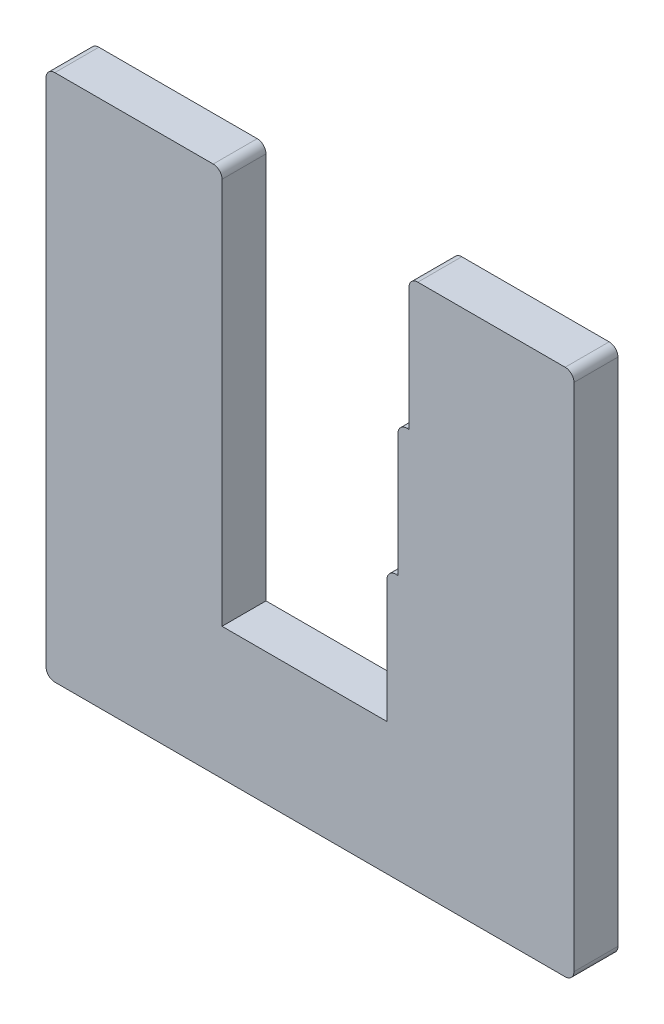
ISO-10303-21;
HEADER;
FILE_DESCRIPTION(('STEP AP214'),'2;1');
FILE_NAME('part.step','',(''),(''),'','','');
FILE_SCHEMA(('AUTOMOTIVE_DESIGN { 1 0 10303 214 1 1 1 1 }'));
ENDSEC;
DATA;
#1=APPLICATION_CONTEXT('core data for automotive mechanical design processes');
#2=APPLICATION_PROTOCOL_DEFINITION('international standard','automotive_design',2000,#1);
#3=PRODUCT_CONTEXT('',#1,'mechanical');
#4=PRODUCT('Part','Part','',(#3));
#5=PRODUCT_RELATED_PRODUCT_CATEGORY('part','',(#4));
#6=PRODUCT_DEFINITION_FORMATION('','',#4);
#7=PRODUCT_DEFINITION_CONTEXT('part definition',#1,'design');
#8=PRODUCT_DEFINITION('design','',#6,#7);
#9=PRODUCT_DEFINITION_SHAPE('','',#8);
#10=(LENGTH_UNIT() NAMED_UNIT(*) SI_UNIT(.MILLI.,.METRE.));
#11=(NAMED_UNIT(*) PLANE_ANGLE_UNIT() SI_UNIT($,.RADIAN.));
#12=(NAMED_UNIT(*) SI_UNIT($,.STERADIAN.) SOLID_ANGLE_UNIT());
#13=UNCERTAINTY_MEASURE_WITH_UNIT(LENGTH_MEASURE(1.E-05),#10,'distance_accuracy_value','');
#14=(GEOMETRIC_REPRESENTATION_CONTEXT(3) GLOBAL_UNCERTAINTY_ASSIGNED_CONTEXT((#13)) GLOBAL_UNIT_ASSIGNED_CONTEXT((#10,
#11,#12)) REPRESENTATION_CONTEXT('',''));
#15=CARTESIAN_POINT('',(0.,0.,0.));
#16=DIRECTION('',(0.,0.,1.));
#17=DIRECTION('',(1.,0.,0.));
#18=AXIS2_PLACEMENT_3D('',#15,#16,#17);
#19=CARTESIAN_POINT('',(0.,120.,10.));
#20=DIRECTION('',(0.,-1.,0.));
#21=DIRECTION('',(0.,0.,-1.));
#22=AXIS2_PLACEMENT_3D('',#19,#20,#21);
#23=PLANE('',#22);
#24=DIRECTION('',(-1.,0.,0.));
#25=VECTOR('',#24,1.);
#26=CARTESIAN_POINT('',(0.,120.,10.));
#27=LINE('',#26,#25);
#28=CARTESIAN_POINT('',(38.,120.,10.));
#29=VERTEX_POINT('',#28);
#30=CARTESIAN_POINT('',(2.,120.,10.));
#31=VERTEX_POINT('',#30);
#32=EDGE_CURVE('E243',#29,#31,#27,.T.);
#33=ORIENTED_EDGE('',*,*,#32,.F.);
#34=DIRECTION('',(0.,0.,1.));
#35=VECTOR('',#34,1.);
#36=CARTESIAN_POINT('',(38.,120.,10.));
#37=LINE('',#36,#35);
#38=CARTESIAN_POINT('',(38.,120.,0.));
#39=VERTEX_POINT('',#38);
#40=EDGE_CURVE('E57',#29,#39,#37,.F.);
#41=ORIENTED_EDGE('',*,*,#40,.T.);
#42=DIRECTION('',(-1.,0.,0.));
#43=VECTOR('',#42,1.);
#44=CARTESIAN_POINT('',(0.,120.,0.));
#45=LINE('',#44,#43);
#46=CARTESIAN_POINT('',(2.,120.,0.));
#47=VERTEX_POINT('',#46);
#48=EDGE_CURVE('E256',#39,#47,#45,.T.);
#49=ORIENTED_EDGE('',*,*,#48,.T.);
#50=DIRECTION('',(0.,0.,-1.));
#51=VECTOR('',#50,1.);
#52=CARTESIAN_POINT('',(2.,120.,10.));
#53=LINE('',#52,#51);
#54=EDGE_CURVE('E314',#47,#31,#53,.F.);
#55=ORIENTED_EDGE('',*,*,#54,.T.);
#56=EDGE_LOOP('',(#33,#41,#49,#55));
#57=FACE_BOUND('',#56,.T.);
#58=ADVANCED_FACE('F35',(#57),#23,.F.);
#59=CARTESIAN_POINT('',(0.,0.,10.));
#60=DIRECTION('',(1.,0.,0.));
#61=DIRECTION('',(0.,0.,-1.));
#62=AXIS2_PLACEMENT_3D('',#59,#60,#61);
#63=PLANE('',#62);
#64=DIRECTION('',(0.,-1.,0.));
#65=VECTOR('',#64,1.);
#66=CARTESIAN_POINT('',(0.,0.,0.));
#67=LINE('',#66,#65);
#68=CARTESIAN_POINT('',(0.,118.,0.));
#69=VERTEX_POINT('',#68);
#70=CARTESIAN_POINT('',(0.,2.,0.));
#71=VERTEX_POINT('',#70);
#72=EDGE_CURVE('E232',#69,#71,#67,.T.);
#73=ORIENTED_EDGE('',*,*,#72,.T.);
#74=DIRECTION('',(0.,0.,-1.));
#75=VECTOR('',#74,1.);
#76=CARTESIAN_POINT('',(0.,2.,10.));
#77=LINE('',#76,#75);
#78=CARTESIAN_POINT('',(0.,2.,10.));
#79=VERTEX_POINT('',#78);
#80=EDGE_CURVE('E310',#71,#79,#77,.F.);
#81=ORIENTED_EDGE('',*,*,#80,.T.);
#82=DIRECTION('',(0.,-1.,0.));
#83=VECTOR('',#82,1.);
#84=CARTESIAN_POINT('',(0.,0.,10.));
#85=LINE('',#84,#83);
#86=CARTESIAN_POINT('',(0.,118.,10.));
#87=VERTEX_POINT('',#86);
#88=EDGE_CURVE('E233',#87,#79,#85,.T.);
#89=ORIENTED_EDGE('',*,*,#88,.F.);
#90=DIRECTION('',(0.,0.,-1.));
#91=VECTOR('',#90,1.);
#92=CARTESIAN_POINT('',(0.,118.,10.));
#93=LINE('',#92,#91);
#94=EDGE_CURVE('E307',#87,#69,#93,.T.);
#95=ORIENTED_EDGE('',*,*,#94,.T.);
#96=EDGE_LOOP('',(#73,#81,#89,#95));
#97=FACE_BOUND('',#96,.T.);
#98=ADVANCED_FACE('F382',(#97),#63,.F.);
#99=CARTESIAN_POINT('',(0.,0.,10.));
#100=DIRECTION('',(0.,1.,0.));
#101=DIRECTION('',(0.,0.,1.));
#102=AXIS2_PLACEMENT_3D('',#99,#100,#101);
#103=PLANE('',#102);
#104=DIRECTION('',(1.,0.,0.));
#105=VECTOR('',#104,1.);
#106=CARTESIAN_POINT('',(0.,0.,0.));
#107=LINE('',#106,#105);
#108=CARTESIAN_POINT('',(2.,0.,0.));
#109=VERTEX_POINT('',#108);
#110=CARTESIAN_POINT('',(118.,0.,0.));
#111=VERTEX_POINT('',#110);
#112=EDGE_CURVE('E250',#109,#111,#107,.T.);
#113=ORIENTED_EDGE('',*,*,#112,.T.);
#114=DIRECTION('',(0.,0.,-1.));
#115=VECTOR('',#114,1.);
#116=CARTESIAN_POINT('',(118.,0.,10.));
#117=LINE('',#116,#115);
#118=CARTESIAN_POINT('',(118.,0.,10.));
#119=VERTEX_POINT('',#118);
#120=EDGE_CURVE('E305',#111,#119,#117,.F.);
#121=ORIENTED_EDGE('',*,*,#120,.T.);
#122=DIRECTION('',(1.,0.,0.));
#123=VECTOR('',#122,1.);
#124=CARTESIAN_POINT('',(0.,0.,10.));
#125=LINE('',#124,#123);
#126=CARTESIAN_POINT('',(2.,0.,10.));
#127=VERTEX_POINT('',#126);
#128=EDGE_CURVE('E236',#127,#119,#125,.T.);
#129=ORIENTED_EDGE('',*,*,#128,.F.);
#130=DIRECTION('',(0.,0.,-1.));
#131=VECTOR('',#130,1.);
#132=CARTESIAN_POINT('',(2.,0.,10.));
#133=LINE('',#132,#131);
#134=EDGE_CURVE('E302',#127,#109,#133,.T.);
#135=ORIENTED_EDGE('',*,*,#134,.T.);
#136=EDGE_LOOP('',(#113,#121,#129,#135));
#137=FACE_BOUND('',#136,.T.);
#138=ADVANCED_FACE('F387',(#137),#103,.F.);
#139=CARTESIAN_POINT('',(120.,0.,10.));
#140=DIRECTION('',(-1.,0.,0.));
#141=DIRECTION('',(0.,0.,1.));
#142=AXIS2_PLACEMENT_3D('',#139,#140,#141);
#143=PLANE('',#142);
#144=DIRECTION('',(0.,1.,0.));
#145=VECTOR('',#144,1.);
#146=CARTESIAN_POINT('',(120.,0.,10.));
#147=LINE('',#146,#145);
#148=CARTESIAN_POINT('',(120.,2.,10.));
#149=VERTEX_POINT('',#148);
#150=CARTESIAN_POINT('',(120.,118.,10.));
#151=VERTEX_POINT('',#150);
#152=EDGE_CURVE('E240',#149,#151,#147,.T.);
#153=ORIENTED_EDGE('',*,*,#152,.F.);
#154=DIRECTION('',(0.,0.,-1.));
#155=VECTOR('',#154,1.);
#156=CARTESIAN_POINT('',(120.,2.,10.));
#157=LINE('',#156,#155);
#158=CARTESIAN_POINT('',(120.,2.,0.));
#159=VERTEX_POINT('',#158);
#160=EDGE_CURVE('E299',#149,#159,#157,.T.);
#161=ORIENTED_EDGE('',*,*,#160,.T.);
#162=DIRECTION('',(0.,1.,0.));
#163=VECTOR('',#162,1.);
#164=CARTESIAN_POINT('',(120.,0.,0.));
#165=LINE('',#164,#163);
#166=CARTESIAN_POINT('',(120.,118.,0.));
#167=VERTEX_POINT('',#166);
#168=EDGE_CURVE('E253',#159,#167,#165,.T.);
#169=ORIENTED_EDGE('',*,*,#168,.T.);
#170=DIRECTION('',(0.,0.,-1.));
#171=VECTOR('',#170,1.);
#172=CARTESIAN_POINT('',(120.,118.,10.));
#173=LINE('',#172,#171);
#174=EDGE_CURVE('E297',#167,#151,#173,.F.);
#175=ORIENTED_EDGE('',*,*,#174,.T.);
#176=EDGE_LOOP('',(#153,#161,#169,#175));
#177=FACE_BOUND('',#176,.T.);
#178=ADVANCED_FACE('F393',(#177),#143,.F.);
#179=CARTESIAN_POINT('',(118.,120.,0.));
#180=VERTEX_POINT('',#179);
#181=CARTESIAN_POINT('',(84.5,120.,0.));
#182=VERTEX_POINT('',#181);
#183=EDGE_CURVE('E237',#180,#182,#45,.T.);
#184=ORIENTED_EDGE('',*,*,#183,.T.);
#185=DIRECTION('',(0.,0.,1.));
#186=VECTOR('',#185,1.);
#187=CARTESIAN_POINT('',(84.5,120.,10.));
#188=LINE('',#187,#186);
#189=CARTESIAN_POINT('',(84.5,120.,10.));
#190=VERTEX_POINT('',#189);
#191=EDGE_CURVE('E43',#182,#190,#188,.T.);
#192=ORIENTED_EDGE('',*,*,#191,.T.);
#193=CARTESIAN_POINT('',(118.,120.,10.));
#194=VERTEX_POINT('',#193);
#195=EDGE_CURVE('E244',#194,#190,#27,.T.);
#196=ORIENTED_EDGE('',*,*,#195,.F.);
#197=DIRECTION('',(0.,0.,-1.));
#198=VECTOR('',#197,1.);
#199=CARTESIAN_POINT('',(118.,120.,10.));
#200=LINE('',#199,#198);
#201=EDGE_CURVE('E317',#194,#180,#200,.T.);
#202=ORIENTED_EDGE('',*,*,#201,.T.);
#203=EDGE_LOOP('',(#184,#192,#196,#202));
#204=FACE_BOUND('',#203,.T.);
#205=ADVANCED_FACE('F324',(#204),#23,.F.);
#206=CARTESIAN_POINT('',(0.,0.,10.));
#207=DIRECTION('',(0.,0.,-1.));
#208=DIRECTION('',(-1.,0.,0.));
#209=AXIS2_PLACEMENT_3D('',#206,#207,#208);
#210=PLANE('',#209);
#211=DIRECTION('',(1.,0.,0.));
#212=VECTOR('',#211,1.);
#213=CARTESIAN_POINT('',(40.,90.,10.));
#214=LINE('',#213,#212);
#215=CARTESIAN_POINT('',(82.,90.,10.));
#216=VERTEX_POINT('',#215);
#217=CARTESIAN_POINT('',(82.5,90.,10.));
#218=VERTEX_POINT('',#217);
#219=EDGE_CURVE('E226',#216,#218,#214,.T.);
#220=ORIENTED_EDGE('',*,*,#219,.F.);
#221=CARTESIAN_POINT('',(82.,88.,10.));
#222=DIRECTION('',(0.,0.,-1.));
#223=DIRECTION('',(-1.,0.,0.));
#224=AXIS2_PLACEMENT_3D('',#221,#222,#223);
#225=CIRCLE('',#224,2.);
#226=CARTESIAN_POINT('',(80.,88.,10.));
#227=VERTEX_POINT('',#226);
#228=EDGE_CURVE('E274',#216,#227,#225,.F.);
#229=ORIENTED_EDGE('',*,*,#228,.T.);
#230=DIRECTION('',(0.,1.,0.));
#231=VECTOR('',#230,1.);
#232=CARTESIAN_POINT('',(80.,90.,10.));
#233=LINE('',#232,#231);
#234=CARTESIAN_POINT('',(80.,60.,10.));
#235=VERTEX_POINT('',#234);
#236=EDGE_CURVE('E212',#235,#227,#233,.T.);
#237=ORIENTED_EDGE('',*,*,#236,.F.);
#238=DIRECTION('',(1.,0.,0.));
#239=VECTOR('',#238,1.);
#240=CARTESIAN_POINT('',(40.,60.,10.));
#241=LINE('',#240,#239);
#242=CARTESIAN_POINT('',(79.5,60.,10.));
#243=VERTEX_POINT('',#242);
#244=EDGE_CURVE('E207',#243,#235,#241,.T.);
#245=ORIENTED_EDGE('',*,*,#244,.F.);
#246=CARTESIAN_POINT('',(79.5,58.,10.));
#247=DIRECTION('',(0.,0.,-1.));
#248=DIRECTION('',(-1.,0.,0.));
#249=AXIS2_PLACEMENT_3D('',#246,#247,#248);
#250=CIRCLE('',#249,2.);
#251=CARTESIAN_POINT('',(77.5,58.,10.));
#252=VERTEX_POINT('',#251);
#253=EDGE_CURVE('E272',#243,#252,#250,.F.);
#254=ORIENTED_EDGE('',*,*,#253,.T.);
#255=DIRECTION('',(0.,1.,0.));
#256=VECTOR('',#255,1.);
#257=CARTESIAN_POINT('',(77.5,60.,10.));
#258=LINE('',#257,#256);
#259=CARTESIAN_POINT('',(77.5,30.,10.));
#260=VERTEX_POINT('',#259);
#261=EDGE_CURVE('E199',#260,#252,#258,.T.);
#262=ORIENTED_EDGE('',*,*,#261,.F.);
#263=DIRECTION('',(1.,0.,0.));
#264=VECTOR('',#263,1.);
#265=CARTESIAN_POINT('',(40.,30.,10.));
#266=LINE('',#265,#264);
#267=CARTESIAN_POINT('',(40.,30.,10.));
#268=VERTEX_POINT('',#267);
#269=EDGE_CURVE('E203',#268,#260,#266,.T.);
#270=ORIENTED_EDGE('',*,*,#269,.F.);
#271=DIRECTION('',(0.,-1.,0.));
#272=VECTOR('',#271,1.);
#273=CARTESIAN_POINT('',(40.,120.,10.));
#274=LINE('',#273,#272);
#275=CARTESIAN_POINT('',(40.,118.,10.));
#276=VERTEX_POINT('',#275);
#277=EDGE_CURVE('E190',#276,#268,#274,.T.);
#278=ORIENTED_EDGE('',*,*,#277,.F.);
#279=CARTESIAN_POINT('',(38.,118.,10.));
#280=DIRECTION('',(0.,0.,-1.));
#281=DIRECTION('',(-1.,0.,0.));
#282=AXIS2_PLACEMENT_3D('',#279,#280,#281);
#283=CIRCLE('',#282,2.);
#284=EDGE_CURVE('E266',#276,#29,#283,.F.);
#285=ORIENTED_EDGE('',*,*,#284,.T.);
#286=ORIENTED_EDGE('',*,*,#32,.T.);
#287=CARTESIAN_POINT('',(2.,118.,10.));
#288=DIRECTION('',(0.,0.,-1.));
#289=DIRECTION('',(-1.,0.,0.));
#290=AXIS2_PLACEMENT_3D('',#287,#288,#289);
#291=CIRCLE('',#290,2.);
#292=EDGE_CURVE('E260',#31,#87,#291,.F.);
#293=ORIENTED_EDGE('',*,*,#292,.T.);
#294=ORIENTED_EDGE('',*,*,#88,.T.);
#295=CARTESIAN_POINT('',(2.,2.,10.));
#296=DIRECTION('',(0.,0.,-1.));
#297=DIRECTION('',(-1.,0.,0.));
#298=AXIS2_PLACEMENT_3D('',#295,#296,#297);
#299=CIRCLE('',#298,2.);
#300=EDGE_CURVE('E268',#79,#127,#299,.F.);
#301=ORIENTED_EDGE('',*,*,#300,.T.);
#302=ORIENTED_EDGE('',*,*,#128,.T.);
#303=CARTESIAN_POINT('',(118.,2.,10.));
#304=DIRECTION('',(0.,0.,-1.));
#305=DIRECTION('',(-1.,0.,0.));
#306=AXIS2_PLACEMENT_3D('',#303,#304,#305);
#307=CIRCLE('',#306,2.);
#308=EDGE_CURVE('E270',#119,#149,#307,.F.);
#309=ORIENTED_EDGE('',*,*,#308,.T.);
#310=ORIENTED_EDGE('',*,*,#152,.T.);
#311=CARTESIAN_POINT('',(118.,118.,10.));
#312=DIRECTION('',(0.,0.,-1.));
#313=DIRECTION('',(-1.,0.,0.));
#314=AXIS2_PLACEMENT_3D('',#311,#312,#313);
#315=CIRCLE('',#314,2.);
#316=EDGE_CURVE('E262',#151,#194,#315,.F.);
#317=ORIENTED_EDGE('',*,*,#316,.T.);
#318=ORIENTED_EDGE('',*,*,#195,.T.);
#319=CARTESIAN_POINT('',(84.5,118.,10.));
#320=DIRECTION('',(0.,0.,-1.));
#321=DIRECTION('',(-1.,0.,0.));
#322=AXIS2_PLACEMENT_3D('',#319,#320,#321);
#323=CIRCLE('',#322,2.);
#324=CARTESIAN_POINT('',(82.5,118.,10.));
#325=VERTEX_POINT('',#324);
#326=EDGE_CURVE('E264',#190,#325,#323,.F.);
#327=ORIENTED_EDGE('',*,*,#326,.T.);
#328=DIRECTION('',(0.,1.,0.));
#329=VECTOR('',#328,1.);
#330=CARTESIAN_POINT('',(82.5,120.,10.));
#331=LINE('',#330,#329);
#332=EDGE_CURVE('E184',#218,#325,#331,.T.);
#333=ORIENTED_EDGE('',*,*,#332,.F.);
#334=EDGE_LOOP('',(#220,#229,#237,#245,#254,#262,#270,#278,#285,#286,#293,#294,#301,#302,#309,
#310,#317,#318,#327,#333));
#335=FACE_BOUND('',#334,.T.);
#336=ADVANCED_FACE('F331',(#335),#210,.F.);
#337=CARTESIAN_POINT('',(0.,0.,0.));
#338=DIRECTION('',(0.,0.,-1.));
#339=DIRECTION('',(-1.,0.,0.));
#340=AXIS2_PLACEMENT_3D('',#337,#338,#339);
#341=PLANE('',#340);
#342=DIRECTION('',(0.,1.,0.));
#343=VECTOR('',#342,1.);
#344=CARTESIAN_POINT('',(80.,90.,0.));
#345=LINE('',#344,#343);
#346=CARTESIAN_POINT('',(80.,60.,0.));
#347=VERTEX_POINT('',#346);
#348=CARTESIAN_POINT('',(80.,88.,0.));
#349=VERTEX_POINT('',#348);
#350=EDGE_CURVE('E211',#347,#349,#345,.T.);
#351=ORIENTED_EDGE('',*,*,#350,.T.);
#352=CARTESIAN_POINT('',(82.,88.,0.));
#353=DIRECTION('',(0.,0.,-1.));
#354=DIRECTION('',(-1.,0.,0.));
#355=AXIS2_PLACEMENT_3D('',#352,#353,#354);
#356=CIRCLE('',#355,2.);
#357=CARTESIAN_POINT('',(82.,90.,0.));
#358=VERTEX_POINT('',#357);
#359=EDGE_CURVE('E290',#349,#358,#356,.T.);
#360=ORIENTED_EDGE('',*,*,#359,.T.);
#361=DIRECTION('',(1.,0.,0.));
#362=VECTOR('',#361,1.);
#363=CARTESIAN_POINT('',(40.,90.,0.));
#364=LINE('',#363,#362);
#365=CARTESIAN_POINT('',(82.5,90.,0.));
#366=VERTEX_POINT('',#365);
#367=EDGE_CURVE('E183',#358,#366,#364,.T.);
#368=ORIENTED_EDGE('',*,*,#367,.T.);
#369=DIRECTION('',(0.,1.,0.));
#370=VECTOR('',#369,1.);
#371=CARTESIAN_POINT('',(82.5,120.,0.));
#372=LINE('',#371,#370);
#373=CARTESIAN_POINT('',(82.5,118.,0.));
#374=VERTEX_POINT('',#373);
#375=EDGE_CURVE('E221',#366,#374,#372,.T.);
#376=ORIENTED_EDGE('',*,*,#375,.T.);
#377=CARTESIAN_POINT('',(84.5,118.,0.));
#378=DIRECTION('',(0.,0.,-1.));
#379=DIRECTION('',(-1.,0.,0.));
#380=AXIS2_PLACEMENT_3D('',#377,#378,#379);
#381=CIRCLE('',#380,2.);
#382=EDGE_CURVE('E281',#374,#182,#381,.T.);
#383=ORIENTED_EDGE('',*,*,#382,.T.);
#384=ORIENTED_EDGE('',*,*,#183,.F.);
#385=CARTESIAN_POINT('',(118.,118.,0.));
#386=DIRECTION('',(0.,0.,-1.));
#387=DIRECTION('',(-1.,0.,0.));
#388=AXIS2_PLACEMENT_3D('',#385,#386,#387);
#389=CIRCLE('',#388,2.);
#390=EDGE_CURVE('E279',#180,#167,#389,.T.);
#391=ORIENTED_EDGE('',*,*,#390,.T.);
#392=ORIENTED_EDGE('',*,*,#168,.F.);
#393=CARTESIAN_POINT('',(118.,2.,0.));
#394=DIRECTION('',(0.,0.,-1.));
#395=DIRECTION('',(-1.,0.,0.));
#396=AXIS2_PLACEMENT_3D('',#393,#394,#395);
#397=CIRCLE('',#396,2.);
#398=EDGE_CURVE('E286',#159,#111,#397,.T.);
#399=ORIENTED_EDGE('',*,*,#398,.T.);
#400=ORIENTED_EDGE('',*,*,#112,.F.);
#401=CARTESIAN_POINT('',(2.,2.,0.));
#402=DIRECTION('',(0.,0.,-1.));
#403=DIRECTION('',(-1.,0.,0.));
#404=AXIS2_PLACEMENT_3D('',#401,#402,#403);
#405=CIRCLE('',#404,2.);
#406=EDGE_CURVE('E284',#109,#71,#405,.T.);
#407=ORIENTED_EDGE('',*,*,#406,.T.);
#408=ORIENTED_EDGE('',*,*,#72,.F.);
#409=CARTESIAN_POINT('',(2.,118.,0.));
#410=DIRECTION('',(0.,0.,-1.));
#411=DIRECTION('',(-1.,0.,0.));
#412=AXIS2_PLACEMENT_3D('',#409,#410,#411);
#413=CIRCLE('',#412,2.);
#414=EDGE_CURVE('E50',#69,#47,#413,.T.);
#415=ORIENTED_EDGE('',*,*,#414,.T.);
#416=ORIENTED_EDGE('',*,*,#48,.F.);
#417=CARTESIAN_POINT('',(38.,118.,0.));
#418=DIRECTION('',(0.,0.,-1.));
#419=DIRECTION('',(-1.,0.,0.));
#420=AXIS2_PLACEMENT_3D('',#417,#418,#419);
#421=CIRCLE('',#420,2.);
#422=CARTESIAN_POINT('',(40.,118.,0.));
#423=VERTEX_POINT('',#422);
#424=EDGE_CURVE('E179',#39,#423,#421,.T.);
#425=ORIENTED_EDGE('',*,*,#424,.T.);
#426=DIRECTION('',(0.,-1.,0.));
#427=VECTOR('',#426,1.);
#428=CARTESIAN_POINT('',(40.,120.,0.));
#429=LINE('',#428,#427);
#430=CARTESIAN_POINT('',(40.,30.,0.));
#431=VERTEX_POINT('',#430);
#432=EDGE_CURVE('E171',#423,#431,#429,.T.);
#433=ORIENTED_EDGE('',*,*,#432,.T.);
#434=DIRECTION('',(1.,0.,0.));
#435=VECTOR('',#434,1.);
#436=CARTESIAN_POINT('',(40.,30.,0.));
#437=LINE('',#436,#435);
#438=CARTESIAN_POINT('',(77.5,30.,0.));
#439=VERTEX_POINT('',#438);
#440=EDGE_CURVE('E177',#431,#439,#437,.T.);
#441=ORIENTED_EDGE('',*,*,#440,.T.);
#442=DIRECTION('',(0.,1.,0.));
#443=VECTOR('',#442,1.);
#444=CARTESIAN_POINT('',(77.5,60.,0.));
#445=LINE('',#444,#443);
#446=CARTESIAN_POINT('',(77.5,58.,0.));
#447=VERTEX_POINT('',#446);
#448=EDGE_CURVE('E195',#439,#447,#445,.T.);
#449=ORIENTED_EDGE('',*,*,#448,.T.);
#450=CARTESIAN_POINT('',(79.5,58.,0.));
#451=DIRECTION('',(0.,0.,-1.));
#452=DIRECTION('',(-1.,0.,0.));
#453=AXIS2_PLACEMENT_3D('',#450,#451,#452);
#454=CIRCLE('',#453,2.);
#455=CARTESIAN_POINT('',(79.5,60.,0.));
#456=VERTEX_POINT('',#455);
#457=EDGE_CURVE('E288',#447,#456,#454,.T.);
#458=ORIENTED_EDGE('',*,*,#457,.T.);
#459=DIRECTION('',(1.,0.,0.));
#460=VECTOR('',#459,1.);
#461=CARTESIAN_POINT('',(40.,60.,0.));
#462=LINE('',#461,#460);
#463=EDGE_CURVE('E209',#456,#347,#462,.T.);
#464=ORIENTED_EDGE('',*,*,#463,.T.);
#465=EDGE_LOOP('',(#351,#360,#368,#376,#383,#384,#391,#392,#399,#400,#407,#408,#415,#416,#425,
#433,#441,#449,#458,#464));
#466=FACE_BOUND('',#465,.T.);
#467=ADVANCED_FACE('F174',(#466),#341,.T.);
#468=CARTESIAN_POINT('',(40.,120.,0.));
#469=DIRECTION('',(-1.,0.,0.));
#470=DIRECTION('',(0.,0.,1.));
#471=AXIS2_PLACEMENT_3D('',#468,#469,#470);
#472=PLANE('',#471);
#473=ORIENTED_EDGE('',*,*,#432,.F.);
#474=DIRECTION('',(0.,0.,1.));
#475=VECTOR('',#474,1.);
#476=CARTESIAN_POINT('',(40.,118.,0.));
#477=LINE('',#476,#475);
#478=EDGE_CURVE('E312',#423,#276,#477,.T.);
#479=ORIENTED_EDGE('',*,*,#478,.T.);
#480=ORIENTED_EDGE('',*,*,#277,.T.);
#481=DIRECTION('',(0.,0.,1.));
#482=VECTOR('',#481,1.);
#483=CARTESIAN_POINT('',(40.,30.,0.));
#484=LINE('',#483,#482);
#485=EDGE_CURVE('E187',#431,#268,#484,.T.);
#486=ORIENTED_EDGE('',*,*,#485,.F.);
#487=EDGE_LOOP('',(#473,#479,#480,#486));
#488=FACE_BOUND('',#487,.T.);
#489=ADVANCED_FACE('F188',(#488),#472,.F.);
#490=CARTESIAN_POINT('',(82.5,120.,0.));
#491=DIRECTION('',(1.,0.,0.));
#492=DIRECTION('',(0.,0.,-1.));
#493=AXIS2_PLACEMENT_3D('',#490,#491,#492);
#494=PLANE('',#493);
#495=ORIENTED_EDGE('',*,*,#332,.T.);
#496=DIRECTION('',(0.,0.,1.));
#497=VECTOR('',#496,1.);
#498=CARTESIAN_POINT('',(82.5,118.,0.));
#499=LINE('',#498,#497);
#500=EDGE_CURVE('E11',#325,#374,#499,.F.);
#501=ORIENTED_EDGE('',*,*,#500,.T.);
#502=ORIENTED_EDGE('',*,*,#375,.F.);
#503=DIRECTION('',(0.,0.,1.));
#504=VECTOR('',#503,1.);
#505=CARTESIAN_POINT('',(82.5,90.,0.));
#506=LINE('',#505,#504);
#507=EDGE_CURVE('E224',#366,#218,#506,.T.);
#508=ORIENTED_EDGE('',*,*,#507,.T.);
#509=EDGE_LOOP('',(#495,#501,#502,#508));
#510=FACE_BOUND('',#509,.T.);
#511=ADVANCED_FACE('F343',(#510),#494,.F.);
#512=CARTESIAN_POINT('',(40.,90.,0.));
#513=DIRECTION('',(0.,-1.,0.));
#514=DIRECTION('',(0.,0.,-1.));
#515=AXIS2_PLACEMENT_3D('',#512,#513,#514);
#516=PLANE('',#515);
#517=ORIENTED_EDGE('',*,*,#367,.F.);
#518=DIRECTION('',(0.,0.,1.));
#519=VECTOR('',#518,1.);
#520=CARTESIAN_POINT('',(82.,90.,0.));
#521=LINE('',#520,#519);
#522=EDGE_CURVE('E247',#358,#216,#521,.T.);
#523=ORIENTED_EDGE('',*,*,#522,.T.);
#524=ORIENTED_EDGE('',*,*,#219,.T.);
#525=ORIENTED_EDGE('',*,*,#507,.F.);
#526=EDGE_LOOP('',(#517,#523,#524,#525));
#527=FACE_BOUND('',#526,.T.);
#528=ADVANCED_FACE('F348',(#527),#516,.F.);
#529=CARTESIAN_POINT('',(80.,90.,0.));
#530=DIRECTION('',(1.,0.,0.));
#531=DIRECTION('',(0.,0.,-1.));
#532=AXIS2_PLACEMENT_3D('',#529,#530,#531);
#533=PLANE('',#532);
#534=ORIENTED_EDGE('',*,*,#236,.T.);
#535=DIRECTION('',(0.,0.,1.));
#536=VECTOR('',#535,1.);
#537=CARTESIAN_POINT('',(80.,88.,0.));
#538=LINE('',#537,#536);
#539=EDGE_CURVE('E276',#227,#349,#538,.F.);
#540=ORIENTED_EDGE('',*,*,#539,.T.);
#541=ORIENTED_EDGE('',*,*,#350,.F.);
#542=DIRECTION('',(0.,0.,1.));
#543=VECTOR('',#542,1.);
#544=CARTESIAN_POINT('',(80.,60.,0.));
#545=LINE('',#544,#543);
#546=EDGE_CURVE('E214',#347,#235,#545,.T.);
#547=ORIENTED_EDGE('',*,*,#546,.T.);
#548=EDGE_LOOP('',(#534,#540,#541,#547));
#549=FACE_BOUND('',#548,.T.);
#550=ADVANCED_FACE('F356',(#549),#533,.F.);
#551=CARTESIAN_POINT('',(40.,60.,0.));
#552=DIRECTION('',(0.,-1.,0.));
#553=DIRECTION('',(0.,0.,-1.));
#554=AXIS2_PLACEMENT_3D('',#551,#552,#553);
#555=PLANE('',#554);
#556=ORIENTED_EDGE('',*,*,#463,.F.);
#557=DIRECTION('',(0.,0.,1.));
#558=VECTOR('',#557,1.);
#559=CARTESIAN_POINT('',(79.5,60.,0.));
#560=LINE('',#559,#558);
#561=EDGE_CURVE('E292',#456,#243,#560,.T.);
#562=ORIENTED_EDGE('',*,*,#561,.T.);
#563=ORIENTED_EDGE('',*,*,#244,.T.);
#564=ORIENTED_EDGE('',*,*,#546,.F.);
#565=EDGE_LOOP('',(#556,#562,#563,#564));
#566=FACE_BOUND('',#565,.T.);
#567=ADVANCED_FACE('F362',(#566),#555,.F.);
#568=CARTESIAN_POINT('',(77.5,60.,0.));
#569=DIRECTION('',(1.,0.,0.));
#570=DIRECTION('',(0.,1.,0.));
#571=AXIS2_PLACEMENT_3D('',#568,#569,#570);
#572=PLANE('',#571);
#573=ORIENTED_EDGE('',*,*,#261,.T.);
#574=DIRECTION('',(0.,0.,1.));
#575=VECTOR('',#574,1.);
#576=CARTESIAN_POINT('',(77.5,58.,0.));
#577=LINE('',#576,#575);
#578=EDGE_CURVE('E295',#252,#447,#577,.F.);
#579=ORIENTED_EDGE('',*,*,#578,.T.);
#580=ORIENTED_EDGE('',*,*,#448,.F.);
#581=DIRECTION('',(0.,0.,1.));
#582=VECTOR('',#581,1.);
#583=CARTESIAN_POINT('',(77.5,30.,0.));
#584=LINE('',#583,#582);
#585=EDGE_CURVE('E194',#439,#260,#584,.T.);
#586=ORIENTED_EDGE('',*,*,#585,.T.);
#587=EDGE_LOOP('',(#573,#579,#580,#586));
#588=FACE_BOUND('',#587,.T.);
#589=ADVANCED_FACE('F368',(#588),#572,.F.);
#590=CARTESIAN_POINT('',(40.,30.,0.));
#591=DIRECTION('',(0.,-1.,0.));
#592=DIRECTION('',(0.,0.,-1.));
#593=AXIS2_PLACEMENT_3D('',#590,#591,#592);
#594=PLANE('',#593);
#595=ORIENTED_EDGE('',*,*,#269,.T.);
#596=ORIENTED_EDGE('',*,*,#585,.F.);
#597=ORIENTED_EDGE('',*,*,#440,.F.);
#598=ORIENTED_EDGE('',*,*,#485,.T.);
#599=EDGE_LOOP('',(#595,#596,#597,#598));
#600=FACE_BOUND('',#599,.T.);
#601=ADVANCED_FACE('F197',(#600),#594,.F.);
#602=CARTESIAN_POINT('',(82.,88.,0.));
#603=DIRECTION('',(0.,0.,1.));
#604=DIRECTION('',(1.,0.,0.));
#605=AXIS2_PLACEMENT_3D('',#602,#603,#604);
#606=CYLINDRICAL_SURFACE('',#605,2.);
#607=ORIENTED_EDGE('',*,*,#359,.F.);
#608=ORIENTED_EDGE('',*,*,#539,.F.);
#609=ORIENTED_EDGE('',*,*,#228,.F.);
#610=ORIENTED_EDGE('',*,*,#522,.F.);
#611=EDGE_LOOP('',(#607,#608,#609,#610));
#612=FACE_BOUND('',#611,.T.);
#613=ADVANCED_FACE('F352',(#612),#606,.T.);
#614=CARTESIAN_POINT('',(79.5,58.,0.));
#615=DIRECTION('',(0.,0.,1.));
#616=DIRECTION('',(1.,0.,0.));
#617=AXIS2_PLACEMENT_3D('',#614,#615,#616);
#618=CYLINDRICAL_SURFACE('',#617,2.);
#619=ORIENTED_EDGE('',*,*,#457,.F.);
#620=ORIENTED_EDGE('',*,*,#578,.F.);
#621=ORIENTED_EDGE('',*,*,#253,.F.);
#622=ORIENTED_EDGE('',*,*,#561,.F.);
#623=EDGE_LOOP('',(#619,#620,#621,#622));
#624=FACE_BOUND('',#623,.T.);
#625=ADVANCED_FACE('F369',(#624),#618,.T.);
#626=CARTESIAN_POINT('',(118.,2.,10.));
#627=DIRECTION('',(0.,0.,-1.));
#628=DIRECTION('',(-1.,0.,0.));
#629=AXIS2_PLACEMENT_3D('',#626,#627,#628);
#630=CYLINDRICAL_SURFACE('',#629,2.);
#631=ORIENTED_EDGE('',*,*,#308,.F.);
#632=ORIENTED_EDGE('',*,*,#120,.F.);
#633=ORIENTED_EDGE('',*,*,#398,.F.);
#634=ORIENTED_EDGE('',*,*,#160,.F.);
#635=EDGE_LOOP('',(#631,#632,#633,#634));
#636=FACE_BOUND('',#635,.T.);
#637=ADVANCED_FACE('F371',(#636),#630,.T.);
#638=CARTESIAN_POINT('',(2.,2.,10.));
#639=DIRECTION('',(0.,0.,-1.));
#640=DIRECTION('',(-1.,0.,0.));
#641=AXIS2_PLACEMENT_3D('',#638,#639,#640);
#642=CYLINDRICAL_SURFACE('',#641,2.);
#643=ORIENTED_EDGE('',*,*,#300,.F.);
#644=ORIENTED_EDGE('',*,*,#80,.F.);
#645=ORIENTED_EDGE('',*,*,#406,.F.);
#646=ORIENTED_EDGE('',*,*,#134,.F.);
#647=EDGE_LOOP('',(#643,#644,#645,#646));
#648=FACE_BOUND('',#647,.T.);
#649=ADVANCED_FACE('F377',(#648),#642,.T.);
#650=CARTESIAN_POINT('',(38.,118.,0.));
#651=DIRECTION('',(0.,0.,1.));
#652=DIRECTION('',(1.,0.,0.));
#653=AXIS2_PLACEMENT_3D('',#650,#651,#652);
#654=CYLINDRICAL_SURFACE('',#653,2.);
#655=ORIENTED_EDGE('',*,*,#424,.F.);
#656=ORIENTED_EDGE('',*,*,#40,.F.);
#657=ORIENTED_EDGE('',*,*,#284,.F.);
#658=ORIENTED_EDGE('',*,*,#478,.F.);
#659=EDGE_LOOP('',(#655,#656,#657,#658));
#660=FACE_BOUND('',#659,.T.);
#661=ADVANCED_FACE('F421',(#660),#654,.T.);
#662=CARTESIAN_POINT('',(84.5,118.,10.));
#663=DIRECTION('',(0.,0.,1.));
#664=DIRECTION('',(1.,0.,0.));
#665=AXIS2_PLACEMENT_3D('',#662,#663,#664);
#666=CYLINDRICAL_SURFACE('',#665,2.);
#667=ORIENTED_EDGE('',*,*,#382,.F.);
#668=ORIENTED_EDGE('',*,*,#500,.F.);
#669=ORIENTED_EDGE('',*,*,#326,.F.);
#670=ORIENTED_EDGE('',*,*,#191,.F.);
#671=EDGE_LOOP('',(#667,#668,#669,#670));
#672=FACE_BOUND('',#671,.T.);
#673=ADVANCED_FACE('F341',(#672),#666,.T.);
#674=CARTESIAN_POINT('',(118.,118.,10.));
#675=DIRECTION('',(0.,0.,-1.));
#676=DIRECTION('',(-1.,0.,0.));
#677=AXIS2_PLACEMENT_3D('',#674,#675,#676);
#678=CYLINDRICAL_SURFACE('',#677,2.);
#679=ORIENTED_EDGE('',*,*,#316,.F.);
#680=ORIENTED_EDGE('',*,*,#174,.F.);
#681=ORIENTED_EDGE('',*,*,#390,.F.);
#682=ORIENTED_EDGE('',*,*,#201,.F.);
#683=EDGE_LOOP('',(#679,#680,#681,#682));
#684=FACE_BOUND('',#683,.T.);
#685=ADVANCED_FACE('F337',(#684),#678,.T.);
#686=CARTESIAN_POINT('',(2.,118.,10.));
#687=DIRECTION('',(0.,0.,-1.));
#688=DIRECTION('',(-1.,0.,0.));
#689=AXIS2_PLACEMENT_3D('',#686,#687,#688);
#690=CYLINDRICAL_SURFACE('',#689,2.);
#691=ORIENTED_EDGE('',*,*,#292,.F.);
#692=ORIENTED_EDGE('',*,*,#54,.F.);
#693=ORIENTED_EDGE('',*,*,#414,.F.);
#694=ORIENTED_EDGE('',*,*,#94,.F.);
#695=EDGE_LOOP('',(#691,#692,#693,#694));
#696=FACE_BOUND('',#695,.T.);
#697=ADVANCED_FACE('F37',(#696),#690,.T.);
#698=CLOSED_SHELL('',(#58,#98,#138,#178,#205,#336,#467,#489,#511,#528,#550,#567,#589,#601,#613,
#625,#637,#649,#661,#673,#685,#697));
#699=MANIFOLD_SOLID_BREP('B2',#698);
#700=ADVANCED_BREP_SHAPE_REPRESENTATION('',(#18,#699),#14);
#701=SHAPE_DEFINITION_REPRESENTATION(#9,#700);
ENDSEC;
END-ISO-10303-21;
